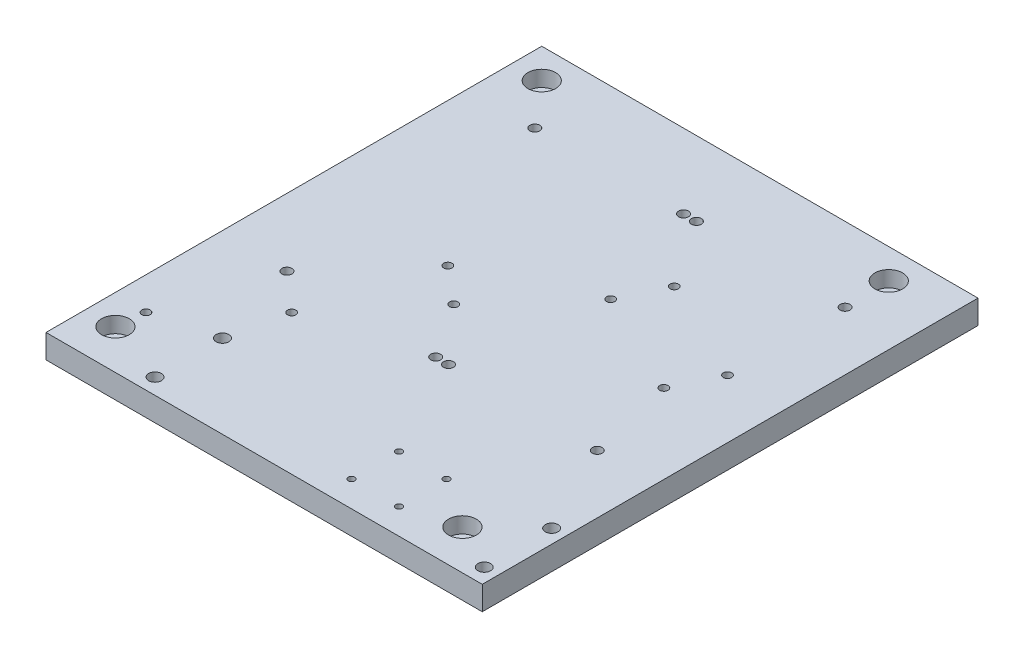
ISO-10303-21;
HEADER;
FILE_DESCRIPTION(('STEP AP214'),'2;1');
FILE_NAME('part.step','',(''),(''),'','','');
FILE_SCHEMA(('AUTOMOTIVE_DESIGN { 1 0 10303 214 1 1 1 1 }'));
ENDSEC;
DATA;
#1=APPLICATION_CONTEXT('core data for automotive mechanical design processes');
#2=APPLICATION_PROTOCOL_DEFINITION('international standard','automotive_design',2000,#1);
#3=PRODUCT_CONTEXT('',#1,'mechanical');
#4=PRODUCT('Part','Part','',(#3));
#5=PRODUCT_RELATED_PRODUCT_CATEGORY('part','',(#4));
#6=PRODUCT_DEFINITION_FORMATION('','',#4);
#7=PRODUCT_DEFINITION_CONTEXT('part definition',#1,'design');
#8=PRODUCT_DEFINITION('design','',#6,#7);
#9=PRODUCT_DEFINITION_SHAPE('','',#8);
#10=(LENGTH_UNIT() NAMED_UNIT(*) SI_UNIT(.MILLI.,.METRE.));
#11=(NAMED_UNIT(*) PLANE_ANGLE_UNIT() SI_UNIT($,.RADIAN.));
#12=(NAMED_UNIT(*) SI_UNIT($,.STERADIAN.) SOLID_ANGLE_UNIT());
#13=UNCERTAINTY_MEASURE_WITH_UNIT(LENGTH_MEASURE(1.E-05),#10,'distance_accuracy_value','');
#14=(GEOMETRIC_REPRESENTATION_CONTEXT(3) GLOBAL_UNCERTAINTY_ASSIGNED_CONTEXT((#13)) GLOBAL_UNIT_ASSIGNED_CONTEXT((#10,
#11,#12)) REPRESENTATION_CONTEXT('',''));
#15=CARTESIAN_POINT('',(0.,0.,0.));
#16=DIRECTION('',(0.,0.,1.));
#17=DIRECTION('',(1.,0.,0.));
#18=AXIS2_PLACEMENT_3D('',#15,#16,#17);
#19=CARTESIAN_POINT('',(-95.,4.,105.));
#20=DIRECTION('',(0.,1.,0.));
#21=DIRECTION('',(0.,0.,1.));
#22=AXIS2_PLACEMENT_3D('',#19,#20,#21);
#23=CYLINDRICAL_SURFACE('',#22,7.00000000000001);
#24=CARTESIAN_POINT('',(-95.,12.,105.));
#25=DIRECTION('',(0.,1.,0.));
#26=DIRECTION('',(0.,0.,1.));
#27=AXIS2_PLACEMENT_3D('',#24,#25,#26);
#28=CIRCLE('',#27,7.00000000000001);
#29=CARTESIAN_POINT('',(-95.,12.,112.));
#30=VERTEX_POINT('',#29);
#31=EDGE_CURVE('E158',#30,#30,#28,.F.);
#32=ORIENTED_EDGE('',*,*,#31,.F.);
#33=EDGE_LOOP('',(#32));
#34=FACE_BOUND('',#33,.T.);
#35=CARTESIAN_POINT('',(-95.,4.,105.));
#36=DIRECTION('',(0.,1.,0.));
#37=DIRECTION('',(0.,0.,1.));
#38=AXIS2_PLACEMENT_3D('',#35,#36,#37);
#39=CIRCLE('',#38,7.00000000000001);
#40=CARTESIAN_POINT('',(-95.,4.,112.));
#41=VERTEX_POINT('',#40);
#42=EDGE_CURVE('E173',#41,#41,#39,.T.);
#43=ORIENTED_EDGE('',*,*,#42,.F.);
#44=EDGE_LOOP('',(#43));
#45=FACE_BOUND('',#44,.T.);
#46=ADVANCED_FACE('F17',(#34,#45),#23,.F.);
#47=CARTESIAN_POINT('',(80.,4.,105.));
#48=DIRECTION('',(0.,1.,0.));
#49=DIRECTION('',(0.,0.,1.));
#50=AXIS2_PLACEMENT_3D('',#47,#48,#49);
#51=CYLINDRICAL_SURFACE('',#50,7.00000000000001);
#52=CARTESIAN_POINT('',(80.,12.,105.));
#53=DIRECTION('',(0.,1.,0.));
#54=DIRECTION('',(0.,0.,1.));
#55=AXIS2_PLACEMENT_3D('',#52,#53,#54);
#56=CIRCLE('',#55,7.00000000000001);
#57=CARTESIAN_POINT('',(80.,12.,112.));
#58=VERTEX_POINT('',#57);
#59=EDGE_CURVE('E155',#58,#58,#56,.F.);
#60=ORIENTED_EDGE('',*,*,#59,.F.);
#61=EDGE_LOOP('',(#60));
#62=FACE_BOUND('',#61,.T.);
#63=CARTESIAN_POINT('',(80.,4.,105.));
#64=DIRECTION('',(0.,1.,0.));
#65=DIRECTION('',(0.,0.,1.));
#66=AXIS2_PLACEMENT_3D('',#63,#64,#65);
#67=CIRCLE('',#66,7.00000000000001);
#68=CARTESIAN_POINT('',(80.,4.,112.));
#69=VERTEX_POINT('',#68);
#70=EDGE_CURVE('E176',#69,#69,#67,.T.);
#71=ORIENTED_EDGE('',*,*,#70,.F.);
#72=EDGE_LOOP('',(#71));
#73=FACE_BOUND('',#72,.T.);
#74=ADVANCED_FACE('F190',(#62,#73),#51,.F.);
#75=CARTESIAN_POINT('',(-95.,4.,-110.));
#76=DIRECTION('',(0.,1.,0.));
#77=DIRECTION('',(0.,0.,1.));
#78=AXIS2_PLACEMENT_3D('',#75,#76,#77);
#79=CYLINDRICAL_SURFACE('',#78,7.00000000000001);
#80=CARTESIAN_POINT('',(-95.,12.,-110.));
#81=DIRECTION('',(0.,1.,0.));
#82=DIRECTION('',(0.,0.,1.));
#83=AXIS2_PLACEMENT_3D('',#80,#81,#82);
#84=CIRCLE('',#83,7.00000000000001);
#85=CARTESIAN_POINT('',(-95.,12.,-103.));
#86=VERTEX_POINT('',#85);
#87=EDGE_CURVE('E152',#86,#86,#84,.F.);
#88=ORIENTED_EDGE('',*,*,#87,.F.);
#89=EDGE_LOOP('',(#88));
#90=FACE_BOUND('',#89,.T.);
#91=CARTESIAN_POINT('',(-95.,4.,-110.));
#92=DIRECTION('',(0.,1.,0.));
#93=DIRECTION('',(0.,0.,1.));
#94=AXIS2_PLACEMENT_3D('',#91,#92,#93);
#95=CIRCLE('',#94,7.00000000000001);
#96=CARTESIAN_POINT('',(-95.,4.,-103.));
#97=VERTEX_POINT('',#96);
#98=EDGE_CURVE('E20',#97,#97,#95,.T.);
#99=ORIENTED_EDGE('',*,*,#98,.F.);
#100=EDGE_LOOP('',(#99));
#101=FACE_BOUND('',#100,.T.);
#102=ADVANCED_FACE('F187',(#90,#101),#79,.F.);
#103=CARTESIAN_POINT('',(80.,4.,-110.));
#104=DIRECTION('',(0.,1.,0.));
#105=DIRECTION('',(0.,0.,1.));
#106=AXIS2_PLACEMENT_3D('',#103,#104,#105);
#107=CYLINDRICAL_SURFACE('',#106,7.00000000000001);
#108=CARTESIAN_POINT('',(80.,12.,-110.));
#109=DIRECTION('',(0.,1.,0.));
#110=DIRECTION('',(0.,0.,1.));
#111=AXIS2_PLACEMENT_3D('',#108,#109,#110);
#112=CIRCLE('',#111,7.00000000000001);
#113=CARTESIAN_POINT('',(80.,12.,-103.));
#114=VERTEX_POINT('',#113);
#115=EDGE_CURVE('E149',#114,#114,#112,.F.);
#116=ORIENTED_EDGE('',*,*,#115,.F.);
#117=EDGE_LOOP('',(#116));
#118=FACE_BOUND('',#117,.T.);
#119=CARTESIAN_POINT('',(80.,4.,-110.));
#120=DIRECTION('',(0.,1.,0.));
#121=DIRECTION('',(0.,0.,1.));
#122=AXIS2_PLACEMENT_3D('',#119,#120,#121);
#123=CIRCLE('',#122,7.00000000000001);
#124=CARTESIAN_POINT('',(80.,4.,-103.));
#125=VERTEX_POINT('',#124);
#126=EDGE_CURVE('E178',#125,#125,#123,.T.);
#127=ORIENTED_EDGE('',*,*,#126,.F.);
#128=EDGE_LOOP('',(#127));
#129=FACE_BOUND('',#128,.T.);
#130=ADVANCED_FACE('F189',(#118,#129),#107,.F.);
#131=CARTESIAN_POINT('',(-63.0000000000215,0.,117.000000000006));
#132=DIRECTION('',(0.,-1.,0.));
#133=DIRECTION('',(0.,0.,-1.));
#134=AXIS2_PLACEMENT_3D('',#131,#132,#133);
#135=CYLINDRICAL_SURFACE('',#134,3.19999999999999);
#136=CARTESIAN_POINT('',(-63.0000000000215,6.8,117.000000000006));
#137=DIRECTION('',(0.,-1.,0.));
#138=DIRECTION('',(0.,0.,-1.));
#139=AXIS2_PLACEMENT_3D('',#136,#137,#138);
#140=CIRCLE('',#139,3.19999999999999);
#141=CARTESIAN_POINT('',(-63.0000000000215,6.8,113.800000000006));
#142=VERTEX_POINT('',#141);
#143=EDGE_CURVE('E170',#142,#142,#140,.T.);
#144=ORIENTED_EDGE('',*,*,#143,.T.);
#145=EDGE_LOOP('',(#144));
#146=FACE_BOUND('',#145,.T.);
#147=CARTESIAN_POINT('',(-63.0000000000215,12.,117.000000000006));
#148=DIRECTION('',(0.,-1.,0.));
#149=DIRECTION('',(0.,0.,-1.));
#150=AXIS2_PLACEMENT_3D('',#147,#148,#149);
#151=CIRCLE('',#150,3.19999999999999);
#152=CARTESIAN_POINT('',(-63.0000000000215,12.,113.800000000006));
#153=VERTEX_POINT('',#152);
#154=EDGE_CURVE('E146',#153,#153,#151,.T.);
#155=ORIENTED_EDGE('',*,*,#154,.F.);
#156=EDGE_LOOP('',(#155));
#157=FACE_BOUND('',#156,.T.);
#158=ADVANCED_FACE('F198',(#146,#157),#135,.F.);
#159=CARTESIAN_POINT('',(-63.0000000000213,0.,83.0000000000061));
#160=DIRECTION('',(0.,-1.,0.));
#161=DIRECTION('',(0.,0.,-1.));
#162=AXIS2_PLACEMENT_3D('',#159,#160,#161);
#163=CYLINDRICAL_SURFACE('',#162,3.19999999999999);
#164=CARTESIAN_POINT('',(-63.0000000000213,6.8,83.0000000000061));
#165=DIRECTION('',(0.,-1.,0.));
#166=DIRECTION('',(0.,0.,-1.));
#167=AXIS2_PLACEMENT_3D('',#164,#165,#166);
#168=CIRCLE('',#167,3.19999999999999);
#169=CARTESIAN_POINT('',(-63.0000000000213,6.8,79.8000000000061));
#170=VERTEX_POINT('',#169);
#171=EDGE_CURVE('E167',#170,#170,#168,.T.);
#172=ORIENTED_EDGE('',*,*,#171,.T.);
#173=EDGE_LOOP('',(#172));
#174=FACE_BOUND('',#173,.T.);
#175=CARTESIAN_POINT('',(-63.0000000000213,12.,83.0000000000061));
#176=DIRECTION('',(0.,-1.,0.));
#177=DIRECTION('',(0.,0.,-1.));
#178=AXIS2_PLACEMENT_3D('',#175,#176,#177);
#179=CIRCLE('',#178,3.19999999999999);
#180=CARTESIAN_POINT('',(-63.0000000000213,12.,79.8000000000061));
#181=VERTEX_POINT('',#180);
#182=EDGE_CURVE('E143',#181,#181,#179,.T.);
#183=ORIENTED_EDGE('',*,*,#182,.F.);
#184=EDGE_LOOP('',(#183));
#185=FACE_BOUND('',#184,.T.);
#186=ADVANCED_FACE('F380',(#174,#185),#163,.F.);
#187=CARTESIAN_POINT('',(102.99999999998,0.,117.000000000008));
#188=DIRECTION('',(0.,-1.,0.));
#189=DIRECTION('',(0.,0.,-1.));
#190=AXIS2_PLACEMENT_3D('',#187,#188,#189);
#191=CYLINDRICAL_SURFACE('',#190,3.19999999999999);
#192=CARTESIAN_POINT('',(102.99999999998,6.8,117.000000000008));
#193=DIRECTION('',(0.,-1.,0.));
#194=DIRECTION('',(0.,0.,-1.));
#195=AXIS2_PLACEMENT_3D('',#192,#193,#194);
#196=CIRCLE('',#195,3.19999999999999);
#197=CARTESIAN_POINT('',(102.99999999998,6.8,113.800000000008));
#198=VERTEX_POINT('',#197);
#199=EDGE_CURVE('E164',#198,#198,#196,.T.);
#200=ORIENTED_EDGE('',*,*,#199,.T.);
#201=EDGE_LOOP('',(#200));
#202=FACE_BOUND('',#201,.T.);
#203=CARTESIAN_POINT('',(102.99999999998,12.,117.000000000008));
#204=DIRECTION('',(0.,-1.,0.));
#205=DIRECTION('',(0.,0.,-1.));
#206=AXIS2_PLACEMENT_3D('',#203,#204,#205);
#207=CIRCLE('',#206,3.19999999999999);
#208=CARTESIAN_POINT('',(102.99999999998,12.,113.800000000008));
#209=VERTEX_POINT('',#208);
#210=EDGE_CURVE('E140',#209,#209,#207,.T.);
#211=ORIENTED_EDGE('',*,*,#210,.F.);
#212=EDGE_LOOP('',(#211));
#213=FACE_BOUND('',#212,.T.);
#214=ADVANCED_FACE('F376',(#202,#213),#191,.F.);
#215=CARTESIAN_POINT('',(102.99999999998,0.,83.0000000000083));
#216=DIRECTION('',(0.,-1.,0.));
#217=DIRECTION('',(0.,0.,-1.));
#218=AXIS2_PLACEMENT_3D('',#215,#216,#217);
#219=CYLINDRICAL_SURFACE('',#218,3.19999999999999);
#220=CARTESIAN_POINT('',(102.99999999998,6.8,83.0000000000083));
#221=DIRECTION('',(0.,-1.,0.));
#222=DIRECTION('',(0.,0.,-1.));
#223=AXIS2_PLACEMENT_3D('',#220,#221,#222);
#224=CIRCLE('',#223,3.19999999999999);
#225=CARTESIAN_POINT('',(102.99999999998,6.8,79.8000000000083));
#226=VERTEX_POINT('',#225);
#227=EDGE_CURVE('E161',#226,#226,#224,.T.);
#228=ORIENTED_EDGE('',*,*,#227,.T.);
#229=EDGE_LOOP('',(#228));
#230=FACE_BOUND('',#229,.T.);
#231=CARTESIAN_POINT('',(102.99999999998,12.,83.0000000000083));
#232=DIRECTION('',(0.,-1.,0.));
#233=DIRECTION('',(0.,0.,-1.));
#234=AXIS2_PLACEMENT_3D('',#231,#232,#233);
#235=CIRCLE('',#234,3.19999999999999);
#236=CARTESIAN_POINT('',(102.99999999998,12.,79.8000000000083));
#237=VERTEX_POINT('',#236);
#238=EDGE_CURVE('E137',#237,#237,#235,.T.);
#239=ORIENTED_EDGE('',*,*,#238,.F.);
#240=EDGE_LOOP('',(#239));
#241=FACE_BOUND('',#240,.T.);
#242=ADVANCED_FACE('F372',(#230,#241),#219,.F.);
#243=CARTESIAN_POINT('',(-95.,4.,-110.));
#244=DIRECTION('',(0.,1.,0.));
#245=DIRECTION('',(0.,0.,1.));
#246=AXIS2_PLACEMENT_3D('',#243,#244,#245);
#247=PLANE('',#246);
#248=CARTESIAN_POINT('',(-95.,4.,-110.));
#249=DIRECTION('',(0.,1.,0.));
#250=DIRECTION('',(0.,0.,1.));
#251=AXIS2_PLACEMENT_3D('',#248,#249,#250);
#252=CIRCLE('',#251,4.25);
#253=CARTESIAN_POINT('',(-95.,4.,-105.75));
#254=VERTEX_POINT('',#253);
#255=EDGE_CURVE('E98',#254,#254,#252,.F.);
#256=ORIENTED_EDGE('',*,*,#255,.T.);
#257=EDGE_LOOP('',(#256));
#258=FACE_BOUND('',#257,.T.);
#259=ORIENTED_EDGE('',*,*,#98,.T.);
#260=EDGE_LOOP('',(#259));
#261=FACE_BOUND('',#260,.T.);
#262=ADVANCED_FACE('F185',(#258,#261),#247,.T.);
#263=CARTESIAN_POINT('',(80.,4.,-110.));
#264=DIRECTION('',(0.,1.,0.));
#265=DIRECTION('',(0.,0.,1.));
#266=AXIS2_PLACEMENT_3D('',#263,#264,#265);
#267=PLANE('',#266);
#268=CARTESIAN_POINT('',(80.,4.,-110.));
#269=DIRECTION('',(0.,1.,0.));
#270=DIRECTION('',(0.,0.,1.));
#271=AXIS2_PLACEMENT_3D('',#268,#269,#270);
#272=CIRCLE('',#271,4.25);
#273=CARTESIAN_POINT('',(80.,4.,-105.75));
#274=VERTEX_POINT('',#273);
#275=EDGE_CURVE('E95',#274,#274,#272,.F.);
#276=ORIENTED_EDGE('',*,*,#275,.T.);
#277=EDGE_LOOP('',(#276));
#278=FACE_BOUND('',#277,.T.);
#279=ORIENTED_EDGE('',*,*,#126,.T.);
#280=EDGE_LOOP('',(#279));
#281=FACE_BOUND('',#280,.T.);
#282=ADVANCED_FACE('F365',(#278,#281),#267,.T.);
#283=CARTESIAN_POINT('',(80.,4.,105.));
#284=DIRECTION('',(0.,1.,0.));
#285=DIRECTION('',(0.,0.,1.));
#286=AXIS2_PLACEMENT_3D('',#283,#284,#285);
#287=PLANE('',#286);
#288=CARTESIAN_POINT('',(80.,4.,105.));
#289=DIRECTION('',(0.,1.,0.));
#290=DIRECTION('',(0.,0.,1.));
#291=AXIS2_PLACEMENT_3D('',#288,#289,#290);
#292=CIRCLE('',#291,4.25);
#293=CARTESIAN_POINT('',(80.,4.,109.25));
#294=VERTEX_POINT('',#293);
#295=EDGE_CURVE('E78',#294,#294,#292,.F.);
#296=ORIENTED_EDGE('',*,*,#295,.T.);
#297=EDGE_LOOP('',(#296));
#298=FACE_BOUND('',#297,.T.);
#299=ORIENTED_EDGE('',*,*,#70,.T.);
#300=EDGE_LOOP('',(#299));
#301=FACE_BOUND('',#300,.T.);
#302=ADVANCED_FACE('F361',(#298,#301),#287,.T.);
#303=CARTESIAN_POINT('',(-95.,4.,105.));
#304=DIRECTION('',(0.,1.,0.));
#305=DIRECTION('',(0.,0.,1.));
#306=AXIS2_PLACEMENT_3D('',#303,#304,#305);
#307=PLANE('',#306);
#308=ORIENTED_EDGE('',*,*,#42,.T.);
#309=EDGE_LOOP('',(#308));
#310=FACE_BOUND('',#309,.T.);
#311=CARTESIAN_POINT('',(-95.,4.,105.));
#312=DIRECTION('',(0.,1.,0.));
#313=DIRECTION('',(0.,0.,1.));
#314=AXIS2_PLACEMENT_3D('',#311,#312,#313);
#315=CIRCLE('',#314,4.25);
#316=CARTESIAN_POINT('',(-95.8888365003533,4.,109.156016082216));
#317=VERTEX_POINT('',#316);
#318=CARTESIAN_POINT('',(-91.9629123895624,4.,107.97297811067));
#319=VERTEX_POINT('',#318);
#320=EDGE_CURVE('E82',#317,#319,#315,.F.);
#321=ORIENTED_EDGE('',*,*,#320,.T.);
#322=CARTESIAN_POINT('',(-93.7946400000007,4.,108.999999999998));
#323=DIRECTION('',(0.,1.,0.));
#324=DIRECTION('',(0.,0.,1.));
#325=AXIS2_PLACEMENT_3D('',#322,#323,#324);
#326=CIRCLE('',#325,2.09999999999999);
#327=EDGE_CURVE('E67',#319,#317,#326,.F.);
#328=ORIENTED_EDGE('',*,*,#327,.T.);
#329=EDGE_LOOP('',(#321,#328));
#330=FACE_BOUND('',#329,.T.);
#331=ADVANCED_FACE('F87',(#310,#330),#307,.T.);
#332=CARTESIAN_POINT('',(-59.8000000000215,6.8,117.000000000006));
#333=DIRECTION('',(0.,1.,0.));
#334=DIRECTION('',(0.,0.,1.));
#335=AXIS2_PLACEMENT_3D('',#332,#333,#334);
#336=PLANE('',#335);
#337=CARTESIAN_POINT('',(-63.0000000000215,6.8,117.000000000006));
#338=DIRECTION('',(0.,-1.,0.));
#339=DIRECTION('',(0.,0.,-1.));
#340=AXIS2_PLACEMENT_3D('',#337,#338,#339);
#341=CIRCLE('',#340,5.50000000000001);
#342=CARTESIAN_POINT('',(-63.0000000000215,6.8,111.500000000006));
#343=VERTEX_POINT('',#342);
#344=EDGE_CURVE('E859',#343,#343,#341,.T.);
#345=ORIENTED_EDGE('',*,*,#344,.T.);
#346=EDGE_LOOP('',(#345));
#347=FACE_BOUND('',#346,.T.);
#348=ORIENTED_EDGE('',*,*,#143,.F.);
#349=EDGE_LOOP('',(#348));
#350=FACE_BOUND('',#349,.T.);
#351=ADVANCED_FACE('F354',(#347,#350),#336,.F.);
#352=CARTESIAN_POINT('',(-59.8000000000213,6.8,83.0000000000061));
#353=DIRECTION('',(0.,1.,0.));
#354=DIRECTION('',(0.,0.,1.));
#355=AXIS2_PLACEMENT_3D('',#352,#353,#354);
#356=PLANE('',#355);
#357=CARTESIAN_POINT('',(-63.0000000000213,6.8,83.0000000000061));
#358=DIRECTION('',(0.,-1.,0.));
#359=DIRECTION('',(0.,0.,-1.));
#360=AXIS2_PLACEMENT_3D('',#357,#358,#359);
#361=CIRCLE('',#360,5.50000000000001);
#362=CARTESIAN_POINT('',(-63.0000000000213,6.8,77.5000000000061));
#363=VERTEX_POINT('',#362);
#364=EDGE_CURVE('E862',#363,#363,#361,.T.);
#365=ORIENTED_EDGE('',*,*,#364,.T.);
#366=EDGE_LOOP('',(#365));
#367=FACE_BOUND('',#366,.T.);
#368=ORIENTED_EDGE('',*,*,#171,.F.);
#369=EDGE_LOOP('',(#368));
#370=FACE_BOUND('',#369,.T.);
#371=ADVANCED_FACE('F350',(#367,#370),#356,.F.);
#372=CARTESIAN_POINT('',(106.19999999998,6.8,117.000000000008));
#373=DIRECTION('',(0.,1.,0.));
#374=DIRECTION('',(0.,0.,1.));
#375=AXIS2_PLACEMENT_3D('',#372,#373,#374);
#376=PLANE('',#375);
#377=CARTESIAN_POINT('',(102.99999999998,6.8,117.000000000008));
#378=DIRECTION('',(0.,-1.,0.));
#379=DIRECTION('',(0.,0.,-1.));
#380=AXIS2_PLACEMENT_3D('',#377,#378,#379);
#381=CIRCLE('',#380,5.50000000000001);
#382=CARTESIAN_POINT('',(102.99999999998,6.8,111.500000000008));
#383=VERTEX_POINT('',#382);
#384=EDGE_CURVE('E865',#383,#383,#381,.T.);
#385=ORIENTED_EDGE('',*,*,#384,.T.);
#386=EDGE_LOOP('',(#385));
#387=FACE_BOUND('',#386,.T.);
#388=ORIENTED_EDGE('',*,*,#199,.F.);
#389=EDGE_LOOP('',(#388));
#390=FACE_BOUND('',#389,.T.);
#391=ADVANCED_FACE('F346',(#387,#390),#376,.F.);
#392=CARTESIAN_POINT('',(106.19999999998,6.8,83.0000000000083));
#393=DIRECTION('',(0.,1.,0.));
#394=DIRECTION('',(0.,0.,1.));
#395=AXIS2_PLACEMENT_3D('',#392,#393,#394);
#396=PLANE('',#395);
#397=CARTESIAN_POINT('',(102.99999999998,6.8,83.0000000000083));
#398=DIRECTION('',(0.,-1.,0.));
#399=DIRECTION('',(0.,0.,-1.));
#400=AXIS2_PLACEMENT_3D('',#397,#398,#399);
#401=CIRCLE('',#400,5.50000000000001);
#402=CARTESIAN_POINT('',(102.99999999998,6.8,77.5000000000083));
#403=VERTEX_POINT('',#402);
#404=EDGE_CURVE('E868',#403,#403,#401,.T.);
#405=ORIENTED_EDGE('',*,*,#404,.T.);
#406=EDGE_LOOP('',(#405));
#407=FACE_BOUND('',#406,.T.);
#408=ORIENTED_EDGE('',*,*,#227,.F.);
#409=EDGE_LOOP('',(#408));
#410=FACE_BOUND('',#409,.T.);
#411=ADVANCED_FACE('F342',(#407,#410),#396,.F.);
#412=CARTESIAN_POINT('',(0.,12.,0.));
#413=DIRECTION('',(0.,1.,0.));
#414=DIRECTION('',(0.,0.,1.));
#415=AXIS2_PLACEMENT_3D('',#412,#413,#414);
#416=PLANE('',#415);
#417=DIRECTION('',(0.,0.,-1.));
#418=VECTOR('',#417,1.);
#419=CARTESIAN_POINT('',(-110.,12.,-125.));
#420=LINE('',#419,#418);
#421=CARTESIAN_POINT('',(-110.,12.,-125.));
#422=VERTEX_POINT('',#421);
#423=CARTESIAN_POINT('',(-110.,12.,125.));
#424=VERTEX_POINT('',#423);
#425=EDGE_CURVE('E962',#422,#424,#420,.F.);
#426=ORIENTED_EDGE('',*,*,#425,.T.);
#427=DIRECTION('',(-1.,0.,0.));
#428=VECTOR('',#427,1.);
#429=CARTESIAN_POINT('',(-110.,12.,125.));
#430=LINE('',#429,#428);
#431=CARTESIAN_POINT('',(110.,12.,125.));
#432=VERTEX_POINT('',#431);
#433=EDGE_CURVE('E967',#424,#432,#430,.F.);
#434=ORIENTED_EDGE('',*,*,#433,.T.);
#435=DIRECTION('',(0.,0.,1.));
#436=VECTOR('',#435,1.);
#437=CARTESIAN_POINT('',(110.,12.,-125.));
#438=LINE('',#437,#436);
#439=CARTESIAN_POINT('',(110.,12.,-125.));
#440=VERTEX_POINT('',#439);
#441=EDGE_CURVE('E970',#432,#440,#438,.F.);
#442=ORIENTED_EDGE('',*,*,#441,.T.);
#443=DIRECTION('',(1.,0.,0.));
#444=VECTOR('',#443,1.);
#445=CARTESIAN_POINT('',(-110.,12.,-125.));
#446=LINE('',#445,#444);
#447=EDGE_CURVE('E871',#440,#422,#446,.F.);
#448=ORIENTED_EDGE('',*,*,#447,.T.);
#449=EDGE_LOOP('',(#426,#434,#442,#448));
#450=FACE_BOUND('',#449,.T.);
#451=ORIENTED_EDGE('',*,*,#238,.T.);
#452=EDGE_LOOP('',(#451));
#453=FACE_BOUND('',#452,.T.);
#454=ORIENTED_EDGE('',*,*,#210,.T.);
#455=EDGE_LOOP('',(#454));
#456=FACE_BOUND('',#455,.T.);
#457=ORIENTED_EDGE('',*,*,#182,.T.);
#458=EDGE_LOOP('',(#457));
#459=FACE_BOUND('',#458,.T.);
#460=ORIENTED_EDGE('',*,*,#154,.T.);
#461=EDGE_LOOP('',(#460));
#462=FACE_BOUND('',#461,.T.);
#463=CARTESIAN_POINT('',(17.8444765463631,12.,-31.9052185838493));
#464=DIRECTION('',(0.,-1.,0.));
#465=DIRECTION('',(0.,0.,-1.));
#466=AXIS2_PLACEMENT_3D('',#463,#464,#465);
#467=CIRCLE('',#466,2.09999999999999);
#468=CARTESIAN_POINT('',(17.8444765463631,12.,-34.0052185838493));
#469=VERTEX_POINT('',#468);
#470=EDGE_CURVE('E397',#469,#469,#467,.T.);
#471=ORIENTED_EDGE('',*,*,#470,.T.);
#472=EDGE_LOOP('',(#471));
#473=FACE_BOUND('',#472,.T.);
#474=CARTESIAN_POINT('',(28.3261454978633,12.,-53.4953694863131));
#475=DIRECTION('',(0.,-1.,0.));
#476=DIRECTION('',(0.,0.,-1.));
#477=AXIS2_PLACEMENT_3D('',#474,#475,#476);
#478=CIRCLE('',#477,2.09999999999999);
#479=CARTESIAN_POINT('',(28.3261454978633,12.,-55.5953694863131));
#480=VERTEX_POINT('',#479);
#481=EDGE_CURVE('E401',#480,#480,#478,.T.);
#482=ORIENTED_EDGE('',*,*,#481,.T.);
#483=EDGE_LOOP('',(#482));
#484=FACE_BOUND('',#483,.T.);
#485=CARTESIAN_POINT('',(80.5023435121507,12.,-28.1646695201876));
#486=DIRECTION('',(0.,-1.,0.));
#487=DIRECTION('',(0.,0.,-1.));
#488=AXIS2_PLACEMENT_3D('',#485,#486,#487);
#489=CIRCLE('',#488,2.09999999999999);
#490=CARTESIAN_POINT('',(80.5023435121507,12.,-30.2646695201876));
#491=VERTEX_POINT('',#490);
#492=EDGE_CURVE('E405',#491,#491,#489,.T.);
#493=ORIENTED_EDGE('',*,*,#492,.T.);
#494=EDGE_LOOP('',(#493));
#495=FACE_BOUND('',#494,.T.);
#496=CARTESIAN_POINT('',(70.0206745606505,12.,-6.57451861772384));
#497=DIRECTION('',(0.,-1.,0.));
#498=DIRECTION('',(0.,0.,-1.));
#499=AXIS2_PLACEMENT_3D('',#496,#497,#498);
#500=CIRCLE('',#499,2.09999999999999);
#501=CARTESIAN_POINT('',(70.0206745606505,12.,-8.67451861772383));
#502=VERTEX_POINT('',#501);
#503=EDGE_CURVE('E409',#502,#502,#500,.T.);
#504=ORIENTED_EDGE('',*,*,#503,.T.);
#505=EDGE_LOOP('',(#504));
#506=FACE_BOUND('',#505,.T.);
#507=CARTESIAN_POINT('',(-75.9999999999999,12.,-87.4999999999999));
#508=DIRECTION('',(0.,1.,0.));
#509=DIRECTION('',(0.,0.,1.));
#510=AXIS2_PLACEMENT_3D('',#507,#508,#509);
#511=CIRCLE('',#510,2.5);
#512=CARTESIAN_POINT('',(-75.9999999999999,12.,-84.9999999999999));
#513=VERTEX_POINT('',#512);
#514=EDGE_CURVE('E413',#513,#513,#511,.F.);
#515=ORIENTED_EDGE('',*,*,#514,.T.);
#516=EDGE_LOOP('',(#515));
#517=FACE_BOUND('',#516,.T.);
#518=CARTESIAN_POINT('',(-0.999999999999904,12.,-87.4999999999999));
#519=DIRECTION('',(0.,1.,0.));
#520=DIRECTION('',(0.,0.,1.));
#521=AXIS2_PLACEMENT_3D('',#518,#519,#520);
#522=CIRCLE('',#521,2.49999999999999);
#523=CARTESIAN_POINT('',(-0.999999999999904,12.,-84.9999999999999));
#524=VERTEX_POINT('',#523);
#525=EDGE_CURVE('E417',#524,#524,#522,.F.);
#526=ORIENTED_EDGE('',*,*,#525,.T.);
#527=EDGE_LOOP('',(#526));
#528=FACE_BOUND('',#527,.T.);
#529=CARTESIAN_POINT('',(-75.9999999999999,12.,37.5000000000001));
#530=DIRECTION('',(0.,1.,0.));
#531=DIRECTION('',(0.,0.,1.));
#532=AXIS2_PLACEMENT_3D('',#529,#530,#531);
#533=CIRCLE('',#532,2.5);
#534=CARTESIAN_POINT('',(-75.9999999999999,12.,40.0000000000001));
#535=VERTEX_POINT('',#534);
#536=EDGE_CURVE('E421',#535,#535,#533,.F.);
#537=ORIENTED_EDGE('',*,*,#536,.T.);
#538=EDGE_LOOP('',(#537));
#539=FACE_BOUND('',#538,.T.);
#540=CARTESIAN_POINT('',(-0.999999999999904,12.,37.5000000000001));
#541=DIRECTION('',(0.,1.,0.));
#542=DIRECTION('',(0.,0.,1.));
#543=AXIS2_PLACEMENT_3D('',#540,#541,#542);
#544=CIRCLE('',#543,2.5);
#545=CARTESIAN_POINT('',(-0.999999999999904,12.,40.0000000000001));
#546=VERTEX_POINT('',#545);
#547=EDGE_CURVE('E85',#546,#546,#544,.F.);
#548=ORIENTED_EDGE('',*,*,#547,.T.);
#549=EDGE_LOOP('',(#548));
#550=FACE_BOUND('',#549,.T.);
#551=ORIENTED_EDGE('',*,*,#115,.T.);
#552=EDGE_LOOP('',(#551));
#553=FACE_BOUND('',#552,.T.);
#554=ORIENTED_EDGE('',*,*,#87,.T.);
#555=EDGE_LOOP('',(#554));
#556=FACE_BOUND('',#555,.T.);
#557=ORIENTED_EDGE('',*,*,#59,.T.);
#558=EDGE_LOOP('',(#557));
#559=FACE_BOUND('',#558,.T.);
#560=ORIENTED_EDGE('',*,*,#31,.T.);
#561=EDGE_LOOP('',(#560));
#562=FACE_BOUND('',#561,.T.);
#563=CARTESIAN_POINT('',(5.49999999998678,12.,37.4999999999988));
#564=DIRECTION('',(0.,1.,0.));
#565=DIRECTION('',(0.,0.,1.));
#566=AXIS2_PLACEMENT_3D('',#563,#564,#565);
#567=CIRCLE('',#566,2.5);
#568=CARTESIAN_POINT('',(5.49999999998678,12.,39.9999999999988));
#569=VERTEX_POINT('',#568);
#570=EDGE_CURVE('E101',#569,#569,#567,.F.);
#571=ORIENTED_EDGE('',*,*,#570,.T.);
#572=EDGE_LOOP('',(#571));
#573=FACE_BOUND('',#572,.T.);
#574=CARTESIAN_POINT('',(80.4999999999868,12.,37.4999999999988));
#575=DIRECTION('',(0.,1.,0.));
#576=DIRECTION('',(0.,0.,1.));
#577=AXIS2_PLACEMENT_3D('',#574,#575,#576);
#578=CIRCLE('',#577,2.5);
#579=CARTESIAN_POINT('',(80.4999999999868,12.,39.9999999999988));
#580=VERTEX_POINT('',#579);
#581=EDGE_CURVE('E104',#580,#580,#578,.F.);
#582=ORIENTED_EDGE('',*,*,#581,.T.);
#583=EDGE_LOOP('',(#582));
#584=FACE_BOUND('',#583,.T.);
#585=CARTESIAN_POINT('',(80.4999999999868,12.,-87.5000000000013));
#586=DIRECTION('',(0.,1.,0.));
#587=DIRECTION('',(0.,0.,1.));
#588=AXIS2_PLACEMENT_3D('',#585,#586,#587);
#589=CIRCLE('',#588,2.5);
#590=CARTESIAN_POINT('',(80.4999999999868,12.,-85.0000000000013));
#591=VERTEX_POINT('',#590);
#592=EDGE_CURVE('E107',#591,#591,#589,.F.);
#593=ORIENTED_EDGE('',*,*,#592,.T.);
#594=EDGE_LOOP('',(#593));
#595=FACE_BOUND('',#594,.T.);
#596=CARTESIAN_POINT('',(5.49999999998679,12.,-87.5000000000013));
#597=DIRECTION('',(0.,1.,0.));
#598=DIRECTION('',(0.,0.,1.));
#599=AXIS2_PLACEMENT_3D('',#596,#597,#598);
#600=CIRCLE('',#599,2.49999999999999);
#601=CARTESIAN_POINT('',(5.49999999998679,12.,-85.0000000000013));
#602=VERTEX_POINT('',#601);
#603=EDGE_CURVE('E110',#602,#602,#600,.F.);
#604=ORIENTED_EDGE('',*,*,#603,.T.);
#605=EDGE_LOOP('',(#604));
#606=FACE_BOUND('',#605,.T.);
#607=CARTESIAN_POINT('',(-93.5736600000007,12.,90.999999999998));
#608=DIRECTION('',(0.,1.,0.));
#609=DIRECTION('',(0.,0.,1.));
#610=AXIS2_PLACEMENT_3D('',#607,#608,#609);
#611=CIRCLE('',#610,2.1);
#612=CARTESIAN_POINT('',(-93.5736600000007,12.,93.099999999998));
#613=VERTEX_POINT('',#612);
#614=EDGE_CURVE('E113',#613,#613,#611,.F.);
#615=ORIENTED_EDGE('',*,*,#614,.T.);
#616=EDGE_LOOP('',(#615));
#617=FACE_BOUND('',#616,.T.);
#618=CARTESIAN_POINT('',(-19.4806399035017,12.,9.9024487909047));
#619=DIRECTION('',(0.,1.,0.));
#620=DIRECTION('',(0.,0.,1.));
#621=AXIS2_PLACEMENT_3D('',#618,#619,#620);
#622=CIRCLE('',#621,2.1);
#623=CARTESIAN_POINT('',(-19.4806399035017,12.,12.0024487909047));
#624=VERTEX_POINT('',#623);
#625=EDGE_CURVE('E116',#624,#624,#622,.F.);
#626=ORIENTED_EDGE('',*,*,#625,.T.);
#627=EDGE_LOOP('',(#626));
#628=FACE_BOUND('',#627,.T.);
#629=CARTESIAN_POINT('',(-37.8657065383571,12.,-5.52445384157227));
#630=DIRECTION('',(0.,1.,0.));
#631=DIRECTION('',(0.,0.,1.));
#632=AXIS2_PLACEMENT_3D('',#629,#630,#631);
#633=CIRCLE('',#632,2.1);
#634=CARTESIAN_POINT('',(-37.8657065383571,12.,-3.42445384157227));
#635=VERTEX_POINT('',#634);
#636=EDGE_CURVE('E119',#635,#635,#633,.F.);
#637=ORIENTED_EDGE('',*,*,#636,.T.);
#638=EDGE_LOOP('',(#637));
#639=FACE_BOUND('',#638,.T.);
#640=CARTESIAN_POINT('',(-56.762321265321,12.,54.3330264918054));
#641=DIRECTION('',(0.,1.,0.));
#642=DIRECTION('',(0.,0.,1.));
#643=AXIS2_PLACEMENT_3D('',#640,#641,#642);
#644=CIRCLE('',#643,2.1);
#645=CARTESIAN_POINT('',(-56.762321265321,12.,56.4330264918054));
#646=VERTEX_POINT('',#645);
#647=EDGE_CURVE('E122',#646,#646,#644,.F.);
#648=ORIENTED_EDGE('',*,*,#647,.T.);
#649=EDGE_LOOP('',(#648));
#650=FACE_BOUND('',#649,.T.);
#651=CARTESIAN_POINT('',(54.9999999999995,12.,111.999999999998));
#652=DIRECTION('',(0.,1.,0.));
#653=DIRECTION('',(0.,0.,1.));
#654=AXIS2_PLACEMENT_3D('',#651,#652,#653);
#655=CIRCLE('',#654,1.65);
#656=CARTESIAN_POINT('',(54.9999999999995,12.,113.649999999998));
#657=VERTEX_POINT('',#656);
#658=EDGE_CURVE('E125',#657,#657,#655,.F.);
#659=ORIENTED_EDGE('',*,*,#658,.T.);
#660=EDGE_LOOP('',(#659));
#661=FACE_BOUND('',#660,.T.);
#662=CARTESIAN_POINT('',(30.9999999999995,12.,111.999999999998));
#663=DIRECTION('',(0.,1.,0.));
#664=DIRECTION('',(0.,0.,1.));
#665=AXIS2_PLACEMENT_3D('',#662,#663,#664);
#666=CIRCLE('',#665,1.65);
#667=CARTESIAN_POINT('',(30.9999999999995,12.,113.649999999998));
#668=VERTEX_POINT('',#667);
#669=EDGE_CURVE('E128',#668,#668,#666,.F.);
#670=ORIENTED_EDGE('',*,*,#669,.T.);
#671=EDGE_LOOP('',(#670));
#672=FACE_BOUND('',#671,.T.);
#673=CARTESIAN_POINT('',(30.9999999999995,12.,87.9999999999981));
#674=DIRECTION('',(0.,1.,0.));
#675=DIRECTION('',(0.,0.,1.));
#676=AXIS2_PLACEMENT_3D('',#673,#674,#675);
#677=CIRCLE('',#676,1.65);
#678=CARTESIAN_POINT('',(30.9999999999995,12.,89.6499999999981));
#679=VERTEX_POINT('',#678);
#680=EDGE_CURVE('E131',#679,#679,#677,.F.);
#681=ORIENTED_EDGE('',*,*,#680,.T.);
#682=EDGE_LOOP('',(#681));
#683=FACE_BOUND('',#682,.T.);
#684=CARTESIAN_POINT('',(54.9999999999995,12.,87.9999999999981));
#685=DIRECTION('',(0.,1.,0.));
#686=DIRECTION('',(0.,0.,1.));
#687=AXIS2_PLACEMENT_3D('',#684,#685,#686);
#688=CIRCLE('',#687,1.65);
#689=CARTESIAN_POINT('',(54.9999999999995,12.,89.6499999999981));
#690=VERTEX_POINT('',#689);
#691=EDGE_CURVE('E134',#690,#690,#688,.F.);
#692=ORIENTED_EDGE('',*,*,#691,.T.);
#693=EDGE_LOOP('',(#692));
#694=FACE_BOUND('',#693,.T.);
#695=ADVANCED_FACE('F338',(#450,#453,#456,#459,#462,#473,#484,#495,#506,#517,#528,#539,#550,
#553,#556,#559,#562,#573,#584,#595,#606,#617,#628,#639,#650,#661,#672,#683,#694),#416,.T.);
#696=CARTESIAN_POINT('',(54.9999999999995,12.,87.9999999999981));
#697=DIRECTION('',(0.,1.,0.));
#698=DIRECTION('',(0.,0.,1.));
#699=AXIS2_PLACEMENT_3D('',#696,#697,#698);
#700=CYLINDRICAL_SURFACE('',#699,1.65);
#701=CARTESIAN_POINT('',(54.9999999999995,0.,87.9999999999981));
#702=DIRECTION('',(0.,1.,0.));
#703=DIRECTION('',(0.,0.,1.));
#704=AXIS2_PLACEMENT_3D('',#701,#702,#703);
#705=CIRCLE('',#704,1.65);
#706=CARTESIAN_POINT('',(54.9999999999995,0.,89.6499999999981));
#707=VERTEX_POINT('',#706);
#708=EDGE_CURVE('E872',#707,#707,#705,.F.);
#709=ORIENTED_EDGE('',*,*,#708,.T.);
#710=EDGE_LOOP('',(#709));
#711=FACE_BOUND('',#710,.T.);
#712=ORIENTED_EDGE('',*,*,#691,.F.);
#713=EDGE_LOOP('',(#712));
#714=FACE_BOUND('',#713,.T.);
#715=ADVANCED_FACE('F334',(#711,#714),#700,.F.);
#716=CARTESIAN_POINT('',(30.9999999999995,12.,87.9999999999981));
#717=DIRECTION('',(0.,1.,0.));
#718=DIRECTION('',(0.,0.,1.));
#719=AXIS2_PLACEMENT_3D('',#716,#717,#718);
#720=CYLINDRICAL_SURFACE('',#719,1.65);
#721=CARTESIAN_POINT('',(30.9999999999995,0.,87.9999999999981));
#722=DIRECTION('',(0.,1.,0.));
#723=DIRECTION('',(0.,0.,1.));
#724=AXIS2_PLACEMENT_3D('',#721,#722,#723);
#725=CIRCLE('',#724,1.65);
#726=CARTESIAN_POINT('',(30.9999999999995,0.,89.6499999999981));
#727=VERTEX_POINT('',#726);
#728=EDGE_CURVE('E875',#727,#727,#725,.F.);
#729=ORIENTED_EDGE('',*,*,#728,.T.);
#730=EDGE_LOOP('',(#729));
#731=FACE_BOUND('',#730,.T.);
#732=ORIENTED_EDGE('',*,*,#680,.F.);
#733=EDGE_LOOP('',(#732));
#734=FACE_BOUND('',#733,.T.);
#735=ADVANCED_FACE('F330',(#731,#734),#720,.F.);
#736=CARTESIAN_POINT('',(30.9999999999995,12.,111.999999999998));
#737=DIRECTION('',(0.,1.,0.));
#738=DIRECTION('',(0.,0.,1.));
#739=AXIS2_PLACEMENT_3D('',#736,#737,#738);
#740=CYLINDRICAL_SURFACE('',#739,1.65);
#741=CARTESIAN_POINT('',(30.9999999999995,0.,111.999999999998));
#742=DIRECTION('',(0.,1.,0.));
#743=DIRECTION('',(0.,0.,1.));
#744=AXIS2_PLACEMENT_3D('',#741,#742,#743);
#745=CIRCLE('',#744,1.65);
#746=CARTESIAN_POINT('',(30.9999999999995,0.,113.649999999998));
#747=VERTEX_POINT('',#746);
#748=EDGE_CURVE('E879',#747,#747,#745,.F.);
#749=ORIENTED_EDGE('',*,*,#748,.T.);
#750=EDGE_LOOP('',(#749));
#751=FACE_BOUND('',#750,.T.);
#752=ORIENTED_EDGE('',*,*,#669,.F.);
#753=EDGE_LOOP('',(#752));
#754=FACE_BOUND('',#753,.T.);
#755=ADVANCED_FACE('F326',(#751,#754),#740,.F.);
#756=CARTESIAN_POINT('',(54.9999999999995,12.,111.999999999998));
#757=DIRECTION('',(0.,1.,0.));
#758=DIRECTION('',(0.,0.,1.));
#759=AXIS2_PLACEMENT_3D('',#756,#757,#758);
#760=CYLINDRICAL_SURFACE('',#759,1.65);
#761=CARTESIAN_POINT('',(54.9999999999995,0.,111.999999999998));
#762=DIRECTION('',(0.,1.,0.));
#763=DIRECTION('',(0.,0.,1.));
#764=AXIS2_PLACEMENT_3D('',#761,#762,#763);
#765=CIRCLE('',#764,1.65);
#766=CARTESIAN_POINT('',(54.9999999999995,0.,113.649999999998));
#767=VERTEX_POINT('',#766);
#768=EDGE_CURVE('E882',#767,#767,#765,.F.);
#769=ORIENTED_EDGE('',*,*,#768,.T.);
#770=EDGE_LOOP('',(#769));
#771=FACE_BOUND('',#770,.T.);
#772=ORIENTED_EDGE('',*,*,#658,.F.);
#773=EDGE_LOOP('',(#772));
#774=FACE_BOUND('',#773,.T.);
#775=ADVANCED_FACE('F322',(#771,#774),#760,.F.);
#776=CARTESIAN_POINT('',(-56.762321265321,12.,54.3330264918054));
#777=DIRECTION('',(0.,1.,0.));
#778=DIRECTION('',(0.,0.,1.));
#779=AXIS2_PLACEMENT_3D('',#776,#777,#778);
#780=CYLINDRICAL_SURFACE('',#779,2.1);
#781=CARTESIAN_POINT('',(-56.762321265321,0.,54.3330264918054));
#782=DIRECTION('',(0.,1.,0.));
#783=DIRECTION('',(0.,0.,1.));
#784=AXIS2_PLACEMENT_3D('',#781,#782,#783);
#785=CIRCLE('',#784,2.1);
#786=CARTESIAN_POINT('',(-56.762321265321,0.,56.4330264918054));
#787=VERTEX_POINT('',#786);
#788=EDGE_CURVE('E885',#787,#787,#785,.F.);
#789=ORIENTED_EDGE('',*,*,#788,.T.);
#790=EDGE_LOOP('',(#789));
#791=FACE_BOUND('',#790,.T.);
#792=ORIENTED_EDGE('',*,*,#647,.F.);
#793=EDGE_LOOP('',(#792));
#794=FACE_BOUND('',#793,.T.);
#795=ADVANCED_FACE('F318',(#791,#794),#780,.F.);
#796=CARTESIAN_POINT('',(-37.8657065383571,12.,-5.52445384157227));
#797=DIRECTION('',(0.,1.,0.));
#798=DIRECTION('',(0.,0.,1.));
#799=AXIS2_PLACEMENT_3D('',#796,#797,#798);
#800=CYLINDRICAL_SURFACE('',#799,2.1);
#801=CARTESIAN_POINT('',(-37.8657065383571,0.,-5.52445384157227));
#802=DIRECTION('',(0.,1.,0.));
#803=DIRECTION('',(0.,0.,1.));
#804=AXIS2_PLACEMENT_3D('',#801,#802,#803);
#805=CIRCLE('',#804,2.1);
#806=CARTESIAN_POINT('',(-37.8657065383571,0.,-3.42445384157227));
#807=VERTEX_POINT('',#806);
#808=EDGE_CURVE('E888',#807,#807,#805,.F.);
#809=ORIENTED_EDGE('',*,*,#808,.T.);
#810=EDGE_LOOP('',(#809));
#811=FACE_BOUND('',#810,.T.);
#812=ORIENTED_EDGE('',*,*,#636,.F.);
#813=EDGE_LOOP('',(#812));
#814=FACE_BOUND('',#813,.T.);
#815=ADVANCED_FACE('F314',(#811,#814),#800,.F.);
#816=CARTESIAN_POINT('',(-19.4806399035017,12.,9.9024487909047));
#817=DIRECTION('',(0.,1.,0.));
#818=DIRECTION('',(0.,0.,1.));
#819=AXIS2_PLACEMENT_3D('',#816,#817,#818);
#820=CYLINDRICAL_SURFACE('',#819,2.1);
#821=CARTESIAN_POINT('',(-19.4806399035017,0.,9.9024487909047));
#822=DIRECTION('',(0.,1.,0.));
#823=DIRECTION('',(0.,0.,1.));
#824=AXIS2_PLACEMENT_3D('',#821,#822,#823);
#825=CIRCLE('',#824,2.1);
#826=CARTESIAN_POINT('',(-19.4806399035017,0.,12.0024487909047));
#827=VERTEX_POINT('',#826);
#828=EDGE_CURVE('E891',#827,#827,#825,.F.);
#829=ORIENTED_EDGE('',*,*,#828,.T.);
#830=EDGE_LOOP('',(#829));
#831=FACE_BOUND('',#830,.T.);
#832=ORIENTED_EDGE('',*,*,#625,.F.);
#833=EDGE_LOOP('',(#832));
#834=FACE_BOUND('',#833,.T.);
#835=ADVANCED_FACE('F310',(#831,#834),#820,.F.);
#836=CARTESIAN_POINT('',(-93.5736600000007,12.,90.999999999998));
#837=DIRECTION('',(0.,1.,0.));
#838=DIRECTION('',(0.,0.,1.));
#839=AXIS2_PLACEMENT_3D('',#836,#837,#838);
#840=CYLINDRICAL_SURFACE('',#839,2.1);
#841=CARTESIAN_POINT('',(-93.5736600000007,0.,90.999999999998));
#842=DIRECTION('',(0.,1.,0.));
#843=DIRECTION('',(0.,0.,1.));
#844=AXIS2_PLACEMENT_3D('',#841,#842,#843);
#845=CIRCLE('',#844,2.1);
#846=CARTESIAN_POINT('',(-93.5736600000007,0.,93.099999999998));
#847=VERTEX_POINT('',#846);
#848=EDGE_CURVE('E894',#847,#847,#845,.F.);
#849=ORIENTED_EDGE('',*,*,#848,.T.);
#850=EDGE_LOOP('',(#849));
#851=FACE_BOUND('',#850,.T.);
#852=ORIENTED_EDGE('',*,*,#614,.F.);
#853=EDGE_LOOP('',(#852));
#854=FACE_BOUND('',#853,.T.);
#855=ADVANCED_FACE('F306',(#851,#854),#840,.F.);
#856=CARTESIAN_POINT('',(5.49999999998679,12.,-87.5000000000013));
#857=DIRECTION('',(0.,1.,0.));
#858=DIRECTION('',(0.,0.,1.));
#859=AXIS2_PLACEMENT_3D('',#856,#857,#858);
#860=CYLINDRICAL_SURFACE('',#859,2.49999999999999);
#861=CARTESIAN_POINT('',(5.49999999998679,0.,-87.5000000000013));
#862=DIRECTION('',(0.,1.,0.));
#863=DIRECTION('',(0.,0.,1.));
#864=AXIS2_PLACEMENT_3D('',#861,#862,#863);
#865=CIRCLE('',#864,2.49999999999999);
#866=CARTESIAN_POINT('',(5.49999999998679,0.,-85.0000000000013));
#867=VERTEX_POINT('',#866);
#868=EDGE_CURVE('E897',#867,#867,#865,.F.);
#869=ORIENTED_EDGE('',*,*,#868,.T.);
#870=EDGE_LOOP('',(#869));
#871=FACE_BOUND('',#870,.T.);
#872=ORIENTED_EDGE('',*,*,#603,.F.);
#873=EDGE_LOOP('',(#872));
#874=FACE_BOUND('',#873,.T.);
#875=ADVANCED_FACE('F302',(#871,#874),#860,.F.);
#876=CARTESIAN_POINT('',(80.4999999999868,12.,-87.5000000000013));
#877=DIRECTION('',(0.,1.,0.));
#878=DIRECTION('',(0.,0.,1.));
#879=AXIS2_PLACEMENT_3D('',#876,#877,#878);
#880=CYLINDRICAL_SURFACE('',#879,2.5);
#881=CARTESIAN_POINT('',(80.4999999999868,0.,-87.5000000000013));
#882=DIRECTION('',(0.,1.,0.));
#883=DIRECTION('',(0.,0.,1.));
#884=AXIS2_PLACEMENT_3D('',#881,#882,#883);
#885=CIRCLE('',#884,2.5);
#886=CARTESIAN_POINT('',(80.4999999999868,0.,-85.0000000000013));
#887=VERTEX_POINT('',#886);
#888=EDGE_CURVE('E900',#887,#887,#885,.F.);
#889=ORIENTED_EDGE('',*,*,#888,.T.);
#890=EDGE_LOOP('',(#889));
#891=FACE_BOUND('',#890,.T.);
#892=ORIENTED_EDGE('',*,*,#592,.F.);
#893=EDGE_LOOP('',(#892));
#894=FACE_BOUND('',#893,.T.);
#895=ADVANCED_FACE('F298',(#891,#894),#880,.F.);
#896=CARTESIAN_POINT('',(80.4999999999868,12.,37.4999999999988));
#897=DIRECTION('',(0.,1.,0.));
#898=DIRECTION('',(0.,0.,1.));
#899=AXIS2_PLACEMENT_3D('',#896,#897,#898);
#900=CYLINDRICAL_SURFACE('',#899,2.5);
#901=CARTESIAN_POINT('',(80.4999999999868,0.,37.4999999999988));
#902=DIRECTION('',(0.,1.,0.));
#903=DIRECTION('',(0.,0.,1.));
#904=AXIS2_PLACEMENT_3D('',#901,#902,#903);
#905=CIRCLE('',#904,2.5);
#906=CARTESIAN_POINT('',(80.4999999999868,0.,39.9999999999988));
#907=VERTEX_POINT('',#906);
#908=EDGE_CURVE('E903',#907,#907,#905,.F.);
#909=ORIENTED_EDGE('',*,*,#908,.T.);
#910=EDGE_LOOP('',(#909));
#911=FACE_BOUND('',#910,.T.);
#912=ORIENTED_EDGE('',*,*,#581,.F.);
#913=EDGE_LOOP('',(#912));
#914=FACE_BOUND('',#913,.T.);
#915=ADVANCED_FACE('F294',(#911,#914),#900,.F.);
#916=CARTESIAN_POINT('',(5.49999999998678,12.,37.4999999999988));
#917=DIRECTION('',(0.,1.,0.));
#918=DIRECTION('',(0.,0.,1.));
#919=AXIS2_PLACEMENT_3D('',#916,#917,#918);
#920=CYLINDRICAL_SURFACE('',#919,2.5);
#921=CARTESIAN_POINT('',(5.49999999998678,0.,37.4999999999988));
#922=DIRECTION('',(0.,1.,0.));
#923=DIRECTION('',(0.,0.,1.));
#924=AXIS2_PLACEMENT_3D('',#921,#922,#923);
#925=CIRCLE('',#924,2.5);
#926=CARTESIAN_POINT('',(5.49999999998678,0.,39.9999999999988));
#927=VERTEX_POINT('',#926);
#928=EDGE_CURVE('E906',#927,#927,#925,.F.);
#929=ORIENTED_EDGE('',*,*,#928,.T.);
#930=EDGE_LOOP('',(#929));
#931=FACE_BOUND('',#930,.T.);
#932=ORIENTED_EDGE('',*,*,#570,.F.);
#933=EDGE_LOOP('',(#932));
#934=FACE_BOUND('',#933,.T.);
#935=ADVANCED_FACE('F290',(#931,#934),#920,.F.);
#936=CARTESIAN_POINT('',(-95.,0.,-110.));
#937=DIRECTION('',(0.,1.,0.));
#938=DIRECTION('',(0.,0.,1.));
#939=AXIS2_PLACEMENT_3D('',#936,#937,#938);
#940=CYLINDRICAL_SURFACE('',#939,4.25);
#941=CARTESIAN_POINT('',(-95.,0.,-110.));
#942=DIRECTION('',(0.,1.,0.));
#943=DIRECTION('',(0.,0.,1.));
#944=AXIS2_PLACEMENT_3D('',#941,#942,#943);
#945=CIRCLE('',#944,4.25);
#946=CARTESIAN_POINT('',(-95.,0.,-105.75));
#947=VERTEX_POINT('',#946);
#948=EDGE_CURVE('E909',#947,#947,#945,.F.);
#949=ORIENTED_EDGE('',*,*,#948,.T.);
#950=EDGE_LOOP('',(#949));
#951=FACE_BOUND('',#950,.T.);
#952=ORIENTED_EDGE('',*,*,#255,.F.);
#953=EDGE_LOOP('',(#952));
#954=FACE_BOUND('',#953,.T.);
#955=ADVANCED_FACE('F286',(#951,#954),#940,.F.);
#956=CARTESIAN_POINT('',(80.,0.,-110.));
#957=DIRECTION('',(0.,1.,0.));
#958=DIRECTION('',(0.,0.,1.));
#959=AXIS2_PLACEMENT_3D('',#956,#957,#958);
#960=CYLINDRICAL_SURFACE('',#959,4.25);
#961=CARTESIAN_POINT('',(80.,0.,-110.));
#962=DIRECTION('',(0.,1.,0.));
#963=DIRECTION('',(0.,0.,1.));
#964=AXIS2_PLACEMENT_3D('',#961,#962,#963);
#965=CIRCLE('',#964,4.25);
#966=CARTESIAN_POINT('',(80.,0.,-105.75));
#967=VERTEX_POINT('',#966);
#968=EDGE_CURVE('E912',#967,#967,#965,.F.);
#969=ORIENTED_EDGE('',*,*,#968,.T.);
#970=EDGE_LOOP('',(#969));
#971=FACE_BOUND('',#970,.T.);
#972=ORIENTED_EDGE('',*,*,#275,.F.);
#973=EDGE_LOOP('',(#972));
#974=FACE_BOUND('',#973,.T.);
#975=ADVANCED_FACE('F282',(#971,#974),#960,.F.);
#976=CARTESIAN_POINT('',(80.,0.,105.));
#977=DIRECTION('',(0.,1.,0.));
#978=DIRECTION('',(0.,0.,1.));
#979=AXIS2_PLACEMENT_3D('',#976,#977,#978);
#980=CYLINDRICAL_SURFACE('',#979,4.25);
#981=CARTESIAN_POINT('',(80.,0.,105.));
#982=DIRECTION('',(0.,1.,0.));
#983=DIRECTION('',(0.,0.,1.));
#984=AXIS2_PLACEMENT_3D('',#981,#982,#983);
#985=CIRCLE('',#984,4.25);
#986=CARTESIAN_POINT('',(80.,0.,109.25));
#987=VERTEX_POINT('',#986);
#988=EDGE_CURVE('E915',#987,#987,#985,.F.);
#989=ORIENTED_EDGE('',*,*,#988,.T.);
#990=EDGE_LOOP('',(#989));
#991=FACE_BOUND('',#990,.T.);
#992=ORIENTED_EDGE('',*,*,#295,.F.);
#993=EDGE_LOOP('',(#992));
#994=FACE_BOUND('',#993,.T.);
#995=ADVANCED_FACE('F279',(#991,#994),#980,.F.);
#996=CARTESIAN_POINT('',(-93.7946400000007,12.,108.999999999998));
#997=DIRECTION('',(0.,1.,0.));
#998=DIRECTION('',(0.,0.,1.));
#999=AXIS2_PLACEMENT_3D('',#996,#997,#998);
#1000=CYLINDRICAL_SURFACE('',#999,2.09999999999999);
#1001=CARTESIAN_POINT('',(-93.7946400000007,0.,108.999999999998));
#1002=DIRECTION('',(0.,1.,0.));
#1003=DIRECTION('',(0.,0.,1.));
#1004=AXIS2_PLACEMENT_3D('',#1001,#1002,#1003);
#1005=CIRCLE('',#1004,2.09999999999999);
#1006=CARTESIAN_POINT('',(-91.9629123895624,0.,107.97297811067));
#1007=VERTEX_POINT('',#1006);
#1008=CARTESIAN_POINT('',(-95.8888365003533,0.,109.156016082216));
#1009=VERTEX_POINT('',#1008);
#1010=EDGE_CURVE('E918',#1007,#1009,#1005,.F.);
#1011=ORIENTED_EDGE('',*,*,#1010,.T.);
#1012=DIRECTION('',(0.,1.,0.));
#1013=VECTOR('',#1012,1.);
#1014=CARTESIAN_POINT('',(-95.8888365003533,0.,109.156016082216));
#1015=LINE('',#1014,#1013);
#1016=EDGE_CURVE('E77',#1009,#317,#1015,.T.);
#1017=ORIENTED_EDGE('',*,*,#1016,.T.);
#1018=ORIENTED_EDGE('',*,*,#327,.F.);
#1019=DIRECTION('',(0.,1.,0.));
#1020=VECTOR('',#1019,1.);
#1021=CARTESIAN_POINT('',(-91.9629123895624,0.,107.97297811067));
#1022=LINE('',#1021,#1020);
#1023=EDGE_CURVE('E74',#319,#1007,#1022,.F.);
#1024=ORIENTED_EDGE('',*,*,#1023,.T.);
#1025=EDGE_LOOP('',(#1011,#1017,#1018,#1024));
#1026=FACE_BOUND('',#1025,.T.);
#1027=ADVANCED_FACE('F73',(#1026),#1000,.F.);
#1028=CARTESIAN_POINT('',(-95.,0.,105.));
#1029=DIRECTION('',(0.,1.,0.));
#1030=DIRECTION('',(0.,0.,1.));
#1031=AXIS2_PLACEMENT_3D('',#1028,#1029,#1030);
#1032=CYLINDRICAL_SURFACE('',#1031,4.25);
#1033=ORIENTED_EDGE('',*,*,#1023,.F.);
#1034=ORIENTED_EDGE('',*,*,#320,.F.);
#1035=ORIENTED_EDGE('',*,*,#1016,.F.);
#1036=CARTESIAN_POINT('',(-95.,0.,105.));
#1037=DIRECTION('',(0.,1.,0.));
#1038=DIRECTION('',(0.,0.,1.));
#1039=AXIS2_PLACEMENT_3D('',#1036,#1037,#1038);
#1040=CIRCLE('',#1039,4.25);
#1041=EDGE_CURVE('E84',#1009,#1007,#1040,.F.);
#1042=ORIENTED_EDGE('',*,*,#1041,.T.);
#1043=EDGE_LOOP('',(#1033,#1034,#1035,#1042));
#1044=FACE_BOUND('',#1043,.T.);
#1045=ADVANCED_FACE('F81',(#1044),#1032,.F.);
#1046=CARTESIAN_POINT('',(-0.999999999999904,12.,37.5000000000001));
#1047=DIRECTION('',(0.,1.,0.));
#1048=DIRECTION('',(0.,0.,1.));
#1049=AXIS2_PLACEMENT_3D('',#1046,#1047,#1048);
#1050=CYLINDRICAL_SURFACE('',#1049,2.5);
#1051=CARTESIAN_POINT('',(-0.999999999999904,0.,37.5000000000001));
#1052=DIRECTION('',(0.,1.,0.));
#1053=DIRECTION('',(0.,0.,1.));
#1054=AXIS2_PLACEMENT_3D('',#1051,#1052,#1053);
#1055=CIRCLE('',#1054,2.5);
#1056=CARTESIAN_POINT('',(-0.999999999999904,0.,40.0000000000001));
#1057=VERTEX_POINT('',#1056);
#1058=EDGE_CURVE('E921',#1057,#1057,#1055,.F.);
#1059=ORIENTED_EDGE('',*,*,#1058,.T.);
#1060=EDGE_LOOP('',(#1059));
#1061=FACE_BOUND('',#1060,.T.);
#1062=ORIENTED_EDGE('',*,*,#547,.F.);
#1063=EDGE_LOOP('',(#1062));
#1064=FACE_BOUND('',#1063,.T.);
#1065=ADVANCED_FACE('F270',(#1061,#1064),#1050,.F.);
#1066=CARTESIAN_POINT('',(-75.9999999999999,12.,37.5000000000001));
#1067=DIRECTION('',(0.,1.,0.));
#1068=DIRECTION('',(0.,0.,1.));
#1069=AXIS2_PLACEMENT_3D('',#1066,#1067,#1068);
#1070=CYLINDRICAL_SURFACE('',#1069,2.5);
#1071=CARTESIAN_POINT('',(-75.9999999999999,0.,37.5000000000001));
#1072=DIRECTION('',(0.,1.,0.));
#1073=DIRECTION('',(0.,0.,1.));
#1074=AXIS2_PLACEMENT_3D('',#1071,#1072,#1073);
#1075=CIRCLE('',#1074,2.5);
#1076=CARTESIAN_POINT('',(-75.9999999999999,0.,40.0000000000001));
#1077=VERTEX_POINT('',#1076);
#1078=EDGE_CURVE('E924',#1077,#1077,#1075,.F.);
#1079=ORIENTED_EDGE('',*,*,#1078,.T.);
#1080=EDGE_LOOP('',(#1079));
#1081=FACE_BOUND('',#1080,.T.);
#1082=ORIENTED_EDGE('',*,*,#536,.F.);
#1083=EDGE_LOOP('',(#1082));
#1084=FACE_BOUND('',#1083,.T.);
#1085=ADVANCED_FACE('F266',(#1081,#1084),#1070,.F.);
#1086=CARTESIAN_POINT('',(-0.999999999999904,12.,-87.4999999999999));
#1087=DIRECTION('',(0.,1.,0.));
#1088=DIRECTION('',(0.,0.,1.));
#1089=AXIS2_PLACEMENT_3D('',#1086,#1087,#1088);
#1090=CYLINDRICAL_SURFACE('',#1089,2.49999999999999);
#1091=CARTESIAN_POINT('',(-0.999999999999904,0.,-87.4999999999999));
#1092=DIRECTION('',(0.,1.,0.));
#1093=DIRECTION('',(0.,0.,1.));
#1094=AXIS2_PLACEMENT_3D('',#1091,#1092,#1093);
#1095=CIRCLE('',#1094,2.49999999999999);
#1096=CARTESIAN_POINT('',(-0.999999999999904,0.,-84.9999999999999));
#1097=VERTEX_POINT('',#1096);
#1098=EDGE_CURVE('E927',#1097,#1097,#1095,.F.);
#1099=ORIENTED_EDGE('',*,*,#1098,.T.);
#1100=EDGE_LOOP('',(#1099));
#1101=FACE_BOUND('',#1100,.T.);
#1102=ORIENTED_EDGE('',*,*,#525,.F.);
#1103=EDGE_LOOP('',(#1102));
#1104=FACE_BOUND('',#1103,.T.);
#1105=ADVANCED_FACE('F262',(#1101,#1104),#1090,.F.);
#1106=CARTESIAN_POINT('',(-75.9999999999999,12.,-87.4999999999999));
#1107=DIRECTION('',(0.,1.,0.));
#1108=DIRECTION('',(0.,0.,1.));
#1109=AXIS2_PLACEMENT_3D('',#1106,#1107,#1108);
#1110=CYLINDRICAL_SURFACE('',#1109,2.5);
#1111=CARTESIAN_POINT('',(-75.9999999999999,0.,-87.4999999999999));
#1112=DIRECTION('',(0.,1.,0.));
#1113=DIRECTION('',(0.,0.,1.));
#1114=AXIS2_PLACEMENT_3D('',#1111,#1112,#1113);
#1115=CIRCLE('',#1114,2.5);
#1116=CARTESIAN_POINT('',(-75.9999999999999,0.,-84.9999999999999));
#1117=VERTEX_POINT('',#1116);
#1118=EDGE_CURVE('E930',#1117,#1117,#1115,.F.);
#1119=ORIENTED_EDGE('',*,*,#1118,.T.);
#1120=EDGE_LOOP('',(#1119));
#1121=FACE_BOUND('',#1120,.T.);
#1122=ORIENTED_EDGE('',*,*,#514,.F.);
#1123=EDGE_LOOP('',(#1122));
#1124=FACE_BOUND('',#1123,.T.);
#1125=ADVANCED_FACE('F258',(#1121,#1124),#1110,.F.);
#1126=CARTESIAN_POINT('',(70.0206745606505,0.,-6.57451861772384));
#1127=DIRECTION('',(0.,-1.,0.));
#1128=DIRECTION('',(0.,0.,-1.));
#1129=AXIS2_PLACEMENT_3D('',#1126,#1127,#1128);
#1130=CYLINDRICAL_SURFACE('',#1129,2.09999999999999);
#1131=ORIENTED_EDGE('',*,*,#503,.F.);
#1132=EDGE_LOOP('',(#1131));
#1133=FACE_BOUND('',#1132,.T.);
#1134=CARTESIAN_POINT('',(70.0206745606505,0.,-6.57451861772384));
#1135=DIRECTION('',(0.,-1.,0.));
#1136=DIRECTION('',(0.,0.,-1.));
#1137=AXIS2_PLACEMENT_3D('',#1134,#1135,#1136);
#1138=CIRCLE('',#1137,2.09999999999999);
#1139=CARTESIAN_POINT('',(70.0206745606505,0.,-8.67451861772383));
#1140=VERTEX_POINT('',#1139);
#1141=EDGE_CURVE('E933',#1140,#1140,#1138,.T.);
#1142=ORIENTED_EDGE('',*,*,#1141,.T.);
#1143=EDGE_LOOP('',(#1142));
#1144=FACE_BOUND('',#1143,.T.);
#1145=ADVANCED_FACE('F254',(#1133,#1144),#1130,.F.);
#1146=CARTESIAN_POINT('',(80.5023435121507,0.,-28.1646695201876));
#1147=DIRECTION('',(0.,-1.,0.));
#1148=DIRECTION('',(0.,0.,-1.));
#1149=AXIS2_PLACEMENT_3D('',#1146,#1147,#1148);
#1150=CYLINDRICAL_SURFACE('',#1149,2.09999999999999);
#1151=ORIENTED_EDGE('',*,*,#492,.F.);
#1152=EDGE_LOOP('',(#1151));
#1153=FACE_BOUND('',#1152,.T.);
#1154=CARTESIAN_POINT('',(80.5023435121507,0.,-28.1646695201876));
#1155=DIRECTION('',(0.,-1.,0.));
#1156=DIRECTION('',(0.,0.,-1.));
#1157=AXIS2_PLACEMENT_3D('',#1154,#1155,#1156);
#1158=CIRCLE('',#1157,2.09999999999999);
#1159=CARTESIAN_POINT('',(80.5023435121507,0.,-30.2646695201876));
#1160=VERTEX_POINT('',#1159);
#1161=EDGE_CURVE('E936',#1160,#1160,#1158,.T.);
#1162=ORIENTED_EDGE('',*,*,#1161,.T.);
#1163=EDGE_LOOP('',(#1162));
#1164=FACE_BOUND('',#1163,.T.);
#1165=ADVANCED_FACE('F250',(#1153,#1164),#1150,.F.);
#1166=CARTESIAN_POINT('',(28.3261454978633,0.,-53.4953694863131));
#1167=DIRECTION('',(0.,-1.,0.));
#1168=DIRECTION('',(0.,0.,-1.));
#1169=AXIS2_PLACEMENT_3D('',#1166,#1167,#1168);
#1170=CYLINDRICAL_SURFACE('',#1169,2.09999999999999);
#1171=ORIENTED_EDGE('',*,*,#481,.F.);
#1172=EDGE_LOOP('',(#1171));
#1173=FACE_BOUND('',#1172,.T.);
#1174=CARTESIAN_POINT('',(28.3261454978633,0.,-53.4953694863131));
#1175=DIRECTION('',(0.,-1.,0.));
#1176=DIRECTION('',(0.,0.,-1.));
#1177=AXIS2_PLACEMENT_3D('',#1174,#1175,#1176);
#1178=CIRCLE('',#1177,2.09999999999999);
#1179=CARTESIAN_POINT('',(28.3261454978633,0.,-55.5953694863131));
#1180=VERTEX_POINT('',#1179);
#1181=EDGE_CURVE('E939',#1180,#1180,#1178,.T.);
#1182=ORIENTED_EDGE('',*,*,#1181,.T.);
#1183=EDGE_LOOP('',(#1182));
#1184=FACE_BOUND('',#1183,.T.);
#1185=ADVANCED_FACE('F246',(#1173,#1184),#1170,.F.);
#1186=CARTESIAN_POINT('',(17.8444765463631,0.,-31.9052185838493));
#1187=DIRECTION('',(0.,-1.,0.));
#1188=DIRECTION('',(0.,0.,-1.));
#1189=AXIS2_PLACEMENT_3D('',#1186,#1187,#1188);
#1190=CYLINDRICAL_SURFACE('',#1189,2.09999999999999);
#1191=ORIENTED_EDGE('',*,*,#470,.F.);
#1192=EDGE_LOOP('',(#1191));
#1193=FACE_BOUND('',#1192,.T.);
#1194=CARTESIAN_POINT('',(17.8444765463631,0.,-31.9052185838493));
#1195=DIRECTION('',(0.,-1.,0.));
#1196=DIRECTION('',(0.,0.,-1.));
#1197=AXIS2_PLACEMENT_3D('',#1194,#1195,#1196);
#1198=CIRCLE('',#1197,2.09999999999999);
#1199=CARTESIAN_POINT('',(17.8444765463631,0.,-34.0052185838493));
#1200=VERTEX_POINT('',#1199);
#1201=EDGE_CURVE('E942',#1200,#1200,#1198,.T.);
#1202=ORIENTED_EDGE('',*,*,#1201,.T.);
#1203=EDGE_LOOP('',(#1202));
#1204=FACE_BOUND('',#1203,.T.);
#1205=ADVANCED_FACE('F242',(#1193,#1204),#1190,.F.);
#1206=CARTESIAN_POINT('',(-63.0000000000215,0.,117.000000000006));
#1207=DIRECTION('',(0.,-1.,0.));
#1208=DIRECTION('',(0.,0.,-1.));
#1209=AXIS2_PLACEMENT_3D('',#1206,#1207,#1208);
#1210=CYLINDRICAL_SURFACE('',#1209,5.50000000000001);
#1211=ORIENTED_EDGE('',*,*,#344,.F.);
#1212=EDGE_LOOP('',(#1211));
#1213=FACE_BOUND('',#1212,.T.);
#1214=CARTESIAN_POINT('',(-63.0000000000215,0.,117.000000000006));
#1215=DIRECTION('',(0.,-1.,0.));
#1216=DIRECTION('',(0.,0.,-1.));
#1217=AXIS2_PLACEMENT_3D('',#1214,#1215,#1216);
#1218=CIRCLE('',#1217,5.50000000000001);
#1219=CARTESIAN_POINT('',(-63.0000000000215,0.,111.500000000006));
#1220=VERTEX_POINT('',#1219);
#1221=EDGE_CURVE('E945',#1220,#1220,#1218,.T.);
#1222=ORIENTED_EDGE('',*,*,#1221,.T.);
#1223=EDGE_LOOP('',(#1222));
#1224=FACE_BOUND('',#1223,.T.);
#1225=ADVANCED_FACE('F238',(#1213,#1224),#1210,.F.);
#1226=CARTESIAN_POINT('',(-63.0000000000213,0.,83.0000000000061));
#1227=DIRECTION('',(0.,-1.,0.));
#1228=DIRECTION('',(0.,0.,-1.));
#1229=AXIS2_PLACEMENT_3D('',#1226,#1227,#1228);
#1230=CYLINDRICAL_SURFACE('',#1229,5.50000000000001);
#1231=ORIENTED_EDGE('',*,*,#364,.F.);
#1232=EDGE_LOOP('',(#1231));
#1233=FACE_BOUND('',#1232,.T.);
#1234=CARTESIAN_POINT('',(-63.0000000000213,0.,83.0000000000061));
#1235=DIRECTION('',(0.,-1.,0.));
#1236=DIRECTION('',(0.,0.,-1.));
#1237=AXIS2_PLACEMENT_3D('',#1234,#1235,#1236);
#1238=CIRCLE('',#1237,5.50000000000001);
#1239=CARTESIAN_POINT('',(-63.0000000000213,0.,77.5000000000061));
#1240=VERTEX_POINT('',#1239);
#1241=EDGE_CURVE('E948',#1240,#1240,#1238,.T.);
#1242=ORIENTED_EDGE('',*,*,#1241,.T.);
#1243=EDGE_LOOP('',(#1242));
#1244=FACE_BOUND('',#1243,.T.);
#1245=ADVANCED_FACE('F234',(#1233,#1244),#1230,.F.);
#1246=CARTESIAN_POINT('',(102.99999999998,0.,117.000000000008));
#1247=DIRECTION('',(0.,-1.,0.));
#1248=DIRECTION('',(0.,0.,-1.));
#1249=AXIS2_PLACEMENT_3D('',#1246,#1247,#1248);
#1250=CYLINDRICAL_SURFACE('',#1249,5.50000000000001);
#1251=ORIENTED_EDGE('',*,*,#384,.F.);
#1252=EDGE_LOOP('',(#1251));
#1253=FACE_BOUND('',#1252,.T.);
#1254=CARTESIAN_POINT('',(102.99999999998,0.,117.000000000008));
#1255=DIRECTION('',(0.,-1.,0.));
#1256=DIRECTION('',(0.,0.,-1.));
#1257=AXIS2_PLACEMENT_3D('',#1254,#1255,#1256);
#1258=CIRCLE('',#1257,5.50000000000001);
#1259=CARTESIAN_POINT('',(102.99999999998,0.,111.500000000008));
#1260=VERTEX_POINT('',#1259);
#1261=EDGE_CURVE('E951',#1260,#1260,#1258,.T.);
#1262=ORIENTED_EDGE('',*,*,#1261,.T.);
#1263=EDGE_LOOP('',(#1262));
#1264=FACE_BOUND('',#1263,.T.);
#1265=ADVANCED_FACE('F230',(#1253,#1264),#1250,.F.);
#1266=CARTESIAN_POINT('',(102.99999999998,0.,83.0000000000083));
#1267=DIRECTION('',(0.,-1.,0.));
#1268=DIRECTION('',(0.,0.,-1.));
#1269=AXIS2_PLACEMENT_3D('',#1266,#1267,#1268);
#1270=CYLINDRICAL_SURFACE('',#1269,5.50000000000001);
#1271=ORIENTED_EDGE('',*,*,#404,.F.);
#1272=EDGE_LOOP('',(#1271));
#1273=FACE_BOUND('',#1272,.T.);
#1274=CARTESIAN_POINT('',(102.99999999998,0.,83.0000000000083));
#1275=DIRECTION('',(0.,-1.,0.));
#1276=DIRECTION('',(0.,0.,-1.));
#1277=AXIS2_PLACEMENT_3D('',#1274,#1275,#1276);
#1278=CIRCLE('',#1277,5.50000000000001);
#1279=CARTESIAN_POINT('',(102.99999999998,0.,77.5000000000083));
#1280=VERTEX_POINT('',#1279);
#1281=EDGE_CURVE('E954',#1280,#1280,#1278,.T.);
#1282=ORIENTED_EDGE('',*,*,#1281,.T.);
#1283=EDGE_LOOP('',(#1282));
#1284=FACE_BOUND('',#1283,.T.);
#1285=ADVANCED_FACE('F226',(#1273,#1284),#1270,.F.);
#1286=CARTESIAN_POINT('',(-110.,12.,-125.));
#1287=DIRECTION('',(0.,0.,1.));
#1288=DIRECTION('',(1.,0.,0.));
#1289=AXIS2_PLACEMENT_3D('',#1286,#1287,#1288);
#1290=PLANE('',#1289);
#1291=DIRECTION('',(0.,1.,0.));
#1292=VECTOR('',#1291,1.);
#1293=CARTESIAN_POINT('',(-110.,12.,-125.));
#1294=LINE('',#1293,#1292);
#1295=CARTESIAN_POINT('',(-110.,0.,-125.));
#1296=VERTEX_POINT('',#1295);
#1297=EDGE_CURVE('E959',#1296,#422,#1294,.T.);
#1298=ORIENTED_EDGE('',*,*,#1297,.T.);
#1299=ORIENTED_EDGE('',*,*,#447,.F.);
#1300=DIRECTION('',(0.,1.,0.));
#1301=VECTOR('',#1300,1.);
#1302=CARTESIAN_POINT('',(110.,12.,-125.));
#1303=LINE('',#1302,#1301);
#1304=CARTESIAN_POINT('',(110.,0.,-125.));
#1305=VERTEX_POINT('',#1304);
#1306=EDGE_CURVE('E876',#440,#1305,#1303,.F.);
#1307=ORIENTED_EDGE('',*,*,#1306,.T.);
#1308=DIRECTION('',(1.,0.,0.));
#1309=VECTOR('',#1308,1.);
#1310=CARTESIAN_POINT('',(0.,0.,-125.));
#1311=LINE('',#1310,#1309);
#1312=EDGE_CURVE('E956',#1305,#1296,#1311,.F.);
#1313=ORIENTED_EDGE('',*,*,#1312,.T.);
#1314=EDGE_LOOP('',(#1298,#1299,#1307,#1313));
#1315=FACE_BOUND('',#1314,.T.);
#1316=ADVANCED_FACE('F222',(#1315),#1290,.F.);
#1317=CARTESIAN_POINT('',(-110.,12.,-125.));
#1318=DIRECTION('',(1.,0.,0.));
#1319=DIRECTION('',(0.,0.,-1.));
#1320=AXIS2_PLACEMENT_3D('',#1317,#1318,#1319);
#1321=PLANE('',#1320);
#1322=DIRECTION('',(0.,1.,0.));
#1323=VECTOR('',#1322,1.);
#1324=CARTESIAN_POINT('',(-110.,12.,125.));
#1325=LINE('',#1324,#1323);
#1326=CARTESIAN_POINT('',(-110.,0.,125.));
#1327=VERTEX_POINT('',#1326);
#1328=EDGE_CURVE('E964',#1327,#424,#1325,.T.);
#1329=ORIENTED_EDGE('',*,*,#1328,.T.);
#1330=ORIENTED_EDGE('',*,*,#425,.F.);
#1331=ORIENTED_EDGE('',*,*,#1297,.F.);
#1332=DIRECTION('',(0.,0.,1.));
#1333=VECTOR('',#1332,1.);
#1334=CARTESIAN_POINT('',(-110.,0.,0.));
#1335=LINE('',#1334,#1333);
#1336=EDGE_CURVE('E977',#1296,#1327,#1335,.T.);
#1337=ORIENTED_EDGE('',*,*,#1336,.T.);
#1338=EDGE_LOOP('',(#1329,#1330,#1331,#1337));
#1339=FACE_BOUND('',#1338,.T.);
#1340=ADVANCED_FACE('F218',(#1339),#1321,.F.);
#1341=CARTESIAN_POINT('',(-110.,12.,125.));
#1342=DIRECTION('',(0.,0.,-1.));
#1343=DIRECTION('',(-1.,0.,0.));
#1344=AXIS2_PLACEMENT_3D('',#1341,#1342,#1343);
#1345=PLANE('',#1344);
#1346=DIRECTION('',(0.,1.,0.));
#1347=VECTOR('',#1346,1.);
#1348=CARTESIAN_POINT('',(110.,12.,125.));
#1349=LINE('',#1348,#1347);
#1350=CARTESIAN_POINT('',(110.,0.,125.));
#1351=VERTEX_POINT('',#1350);
#1352=EDGE_CURVE('E34',#1351,#432,#1349,.T.);
#1353=ORIENTED_EDGE('',*,*,#1352,.T.);
#1354=ORIENTED_EDGE('',*,*,#433,.F.);
#1355=ORIENTED_EDGE('',*,*,#1328,.F.);
#1356=DIRECTION('',(1.,0.,0.));
#1357=VECTOR('',#1356,1.);
#1358=CARTESIAN_POINT('',(0.,0.,125.));
#1359=LINE('',#1358,#1357);
#1360=EDGE_CURVE('E26',#1327,#1351,#1359,.T.);
#1361=ORIENTED_EDGE('',*,*,#1360,.T.);
#1362=EDGE_LOOP('',(#1353,#1354,#1355,#1361));
#1363=FACE_BOUND('',#1362,.T.);
#1364=ADVANCED_FACE('F211',(#1363),#1345,.F.);
#1365=CARTESIAN_POINT('',(110.,12.,-125.));
#1366=DIRECTION('',(-1.,0.,0.));
#1367=DIRECTION('',(0.,0.,1.));
#1368=AXIS2_PLACEMENT_3D('',#1365,#1366,#1367);
#1369=PLANE('',#1368);
#1370=ORIENTED_EDGE('',*,*,#1306,.F.);
#1371=ORIENTED_EDGE('',*,*,#441,.F.);
#1372=ORIENTED_EDGE('',*,*,#1352,.F.);
#1373=DIRECTION('',(0.,0.,1.));
#1374=VECTOR('',#1373,1.);
#1375=CARTESIAN_POINT('',(110.,0.,0.));
#1376=LINE('',#1375,#1374);
#1377=EDGE_CURVE('E11',#1351,#1305,#1376,.F.);
#1378=ORIENTED_EDGE('',*,*,#1377,.T.);
#1379=EDGE_LOOP('',(#1370,#1371,#1372,#1378));
#1380=FACE_BOUND('',#1379,.T.);
#1381=ADVANCED_FACE('F205',(#1380),#1369,.F.);
#1382=CARTESIAN_POINT('',(0.,0.,0.));
#1383=DIRECTION('',(0.,1.,0.));
#1384=DIRECTION('',(0.,0.,1.));
#1385=AXIS2_PLACEMENT_3D('',#1382,#1383,#1384);
#1386=PLANE('',#1385);
#1387=ORIENTED_EDGE('',*,*,#1360,.F.);
#1388=ORIENTED_EDGE('',*,*,#1336,.F.);
#1389=ORIENTED_EDGE('',*,*,#1312,.F.);
#1390=ORIENTED_EDGE('',*,*,#1377,.F.);
#1391=EDGE_LOOP('',(#1387,#1388,#1389,#1390));
#1392=FACE_BOUND('',#1391,.T.);
#1393=ORIENTED_EDGE('',*,*,#1281,.F.);
#1394=EDGE_LOOP('',(#1393));
#1395=FACE_BOUND('',#1394,.T.);
#1396=ORIENTED_EDGE('',*,*,#1261,.F.);
#1397=EDGE_LOOP('',(#1396));
#1398=FACE_BOUND('',#1397,.T.);
#1399=ORIENTED_EDGE('',*,*,#1241,.F.);
#1400=EDGE_LOOP('',(#1399));
#1401=FACE_BOUND('',#1400,.T.);
#1402=ORIENTED_EDGE('',*,*,#1221,.F.);
#1403=EDGE_LOOP('',(#1402));
#1404=FACE_BOUND('',#1403,.T.);
#1405=ORIENTED_EDGE('',*,*,#1201,.F.);
#1406=EDGE_LOOP('',(#1405));
#1407=FACE_BOUND('',#1406,.T.);
#1408=ORIENTED_EDGE('',*,*,#1181,.F.);
#1409=EDGE_LOOP('',(#1408));
#1410=FACE_BOUND('',#1409,.T.);
#1411=ORIENTED_EDGE('',*,*,#1161,.F.);
#1412=EDGE_LOOP('',(#1411));
#1413=FACE_BOUND('',#1412,.T.);
#1414=ORIENTED_EDGE('',*,*,#1141,.F.);
#1415=EDGE_LOOP('',(#1414));
#1416=FACE_BOUND('',#1415,.T.);
#1417=ORIENTED_EDGE('',*,*,#1118,.F.);
#1418=EDGE_LOOP('',(#1417));
#1419=FACE_BOUND('',#1418,.T.);
#1420=ORIENTED_EDGE('',*,*,#1098,.F.);
#1421=EDGE_LOOP('',(#1420));
#1422=FACE_BOUND('',#1421,.T.);
#1423=ORIENTED_EDGE('',*,*,#1078,.F.);
#1424=EDGE_LOOP('',(#1423));
#1425=FACE_BOUND('',#1424,.T.);
#1426=ORIENTED_EDGE('',*,*,#1058,.F.);
#1427=EDGE_LOOP('',(#1426));
#1428=FACE_BOUND('',#1427,.T.);
#1429=ORIENTED_EDGE('',*,*,#1041,.F.);
#1430=ORIENTED_EDGE('',*,*,#1010,.F.);
#1431=EDGE_LOOP('',(#1429,#1430));
#1432=FACE_BOUND('',#1431,.T.);
#1433=ORIENTED_EDGE('',*,*,#988,.F.);
#1434=EDGE_LOOP('',(#1433));
#1435=FACE_BOUND('',#1434,.T.);
#1436=ORIENTED_EDGE('',*,*,#968,.F.);
#1437=EDGE_LOOP('',(#1436));
#1438=FACE_BOUND('',#1437,.T.);
#1439=ORIENTED_EDGE('',*,*,#948,.F.);
#1440=EDGE_LOOP('',(#1439));
#1441=FACE_BOUND('',#1440,.T.);
#1442=ORIENTED_EDGE('',*,*,#928,.F.);
#1443=EDGE_LOOP('',(#1442));
#1444=FACE_BOUND('',#1443,.T.);
#1445=ORIENTED_EDGE('',*,*,#908,.F.);
#1446=EDGE_LOOP('',(#1445));
#1447=FACE_BOUND('',#1446,.T.);
#1448=ORIENTED_EDGE('',*,*,#888,.F.);
#1449=EDGE_LOOP('',(#1448));
#1450=FACE_BOUND('',#1449,.T.);
#1451=ORIENTED_EDGE('',*,*,#868,.F.);
#1452=EDGE_LOOP('',(#1451));
#1453=FACE_BOUND('',#1452,.T.);
#1454=ORIENTED_EDGE('',*,*,#848,.F.);
#1455=EDGE_LOOP('',(#1454));
#1456=FACE_BOUND('',#1455,.T.);
#1457=ORIENTED_EDGE('',*,*,#828,.F.);
#1458=EDGE_LOOP('',(#1457));
#1459=FACE_BOUND('',#1458,.T.);
#1460=ORIENTED_EDGE('',*,*,#808,.F.);
#1461=EDGE_LOOP('',(#1460));
#1462=FACE_BOUND('',#1461,.T.);
#1463=ORIENTED_EDGE('',*,*,#788,.F.);
#1464=EDGE_LOOP('',(#1463));
#1465=FACE_BOUND('',#1464,.T.);
#1466=ORIENTED_EDGE('',*,*,#768,.F.);
#1467=EDGE_LOOP('',(#1466));
#1468=FACE_BOUND('',#1467,.T.);
#1469=ORIENTED_EDGE('',*,*,#748,.F.);
#1470=EDGE_LOOP('',(#1469));
#1471=FACE_BOUND('',#1470,.T.);
#1472=ORIENTED_EDGE('',*,*,#728,.F.);
#1473=EDGE_LOOP('',(#1472));
#1474=FACE_BOUND('',#1473,.T.);
#1475=ORIENTED_EDGE('',*,*,#708,.F.);
#1476=EDGE_LOOP('',(#1475));
#1477=FACE_BOUND('',#1476,.T.);
#1478=ADVANCED_FACE('F203',(#1392,#1395,#1398,#1401,#1404,#1407,#1410,#1413,#1416,#1419,#1422,
#1425,#1428,#1432,#1435,#1438,#1441,#1444,#1447,#1450,#1453,#1456,#1459,#1462,#1465,#1468,#1471,
#1474,#1477),#1386,.F.);
#1479=CLOSED_SHELL('',(#46,#74,#102,#130,#158,#186,#214,#242,#262,#282,#302,#331,#351,#371,#391,
#411,#695,#715,#735,#755,#775,#795,#815,#835,#855,#875,#895,#915,#935,#955,#975,#995,#1027,
#1045,#1065,#1085,#1105,#1125,#1145,#1165,#1185,#1205,#1225,#1245,#1265,#1285,#1316,#1340,#1364,
#1381,#1478));
#1480=MANIFOLD_SOLID_BREP('B1',#1479);
#1481=ADVANCED_BREP_SHAPE_REPRESENTATION('',(#18,#1480),#14);
#1482=SHAPE_DEFINITION_REPRESENTATION(#9,#1481);
ENDSEC;
END-ISO-10303-21;
